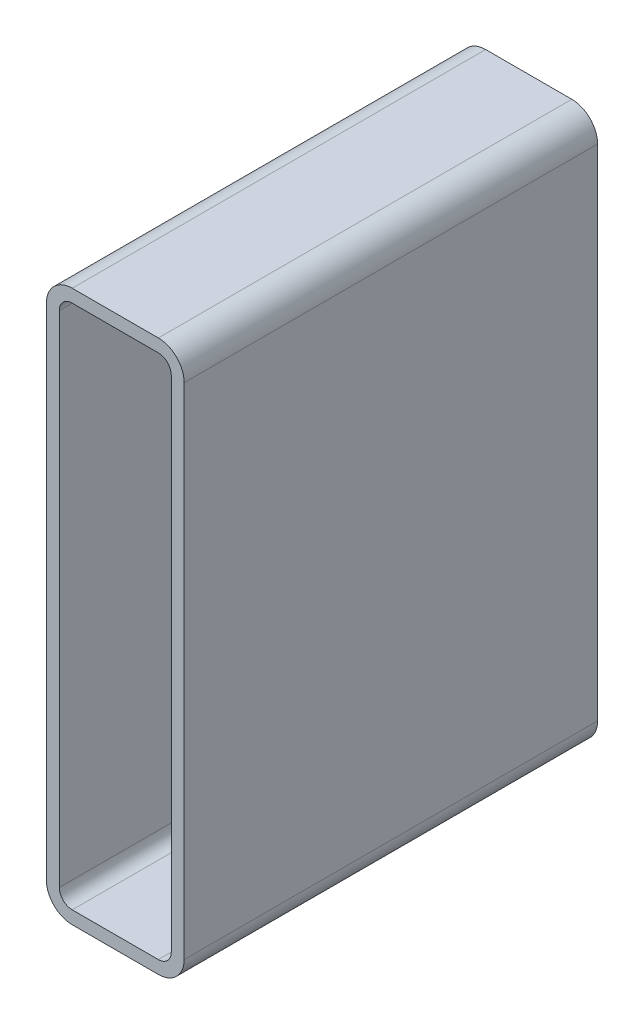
ISO-10303-21;
HEADER;
FILE_DESCRIPTION(('STEP AP214'),'2;1');
FILE_NAME('part.step','',(''),(''),'','','');
FILE_SCHEMA(('AUTOMOTIVE_DESIGN { 1 0 10303 214 1 1 1 1 }'));
ENDSEC;
DATA;
#1=APPLICATION_CONTEXT('core data for automotive mechanical design processes');
#2=APPLICATION_PROTOCOL_DEFINITION('international standard','automotive_design',2000,#1);
#3=PRODUCT_CONTEXT('',#1,'mechanical');
#4=PRODUCT('Part','Part','',(#3));
#5=PRODUCT_RELATED_PRODUCT_CATEGORY('part','',(#4));
#6=PRODUCT_DEFINITION_FORMATION('','',#4);
#7=PRODUCT_DEFINITION_CONTEXT('part definition',#1,'design');
#8=PRODUCT_DEFINITION('design','',#6,#7);
#9=PRODUCT_DEFINITION_SHAPE('','',#8);
#10=(LENGTH_UNIT() NAMED_UNIT(*) SI_UNIT(.MILLI.,.METRE.));
#11=(NAMED_UNIT(*) PLANE_ANGLE_UNIT() SI_UNIT($,.RADIAN.));
#12=(NAMED_UNIT(*) SI_UNIT($,.STERADIAN.) SOLID_ANGLE_UNIT());
#13=UNCERTAINTY_MEASURE_WITH_UNIT(LENGTH_MEASURE(1.E-05),#10,'distance_accuracy_value','');
#14=(GEOMETRIC_REPRESENTATION_CONTEXT(3) GLOBAL_UNCERTAINTY_ASSIGNED_CONTEXT((#13)) GLOBAL_UNIT_ASSIGNED_CONTEXT((#10,
#11,#12)) REPRESENTATION_CONTEXT('',''));
#15=CARTESIAN_POINT('',(0.,0.,0.));
#16=DIRECTION('',(0.,0.,1.));
#17=DIRECTION('',(1.,0.,0.));
#18=AXIS2_PLACEMENT_3D('',#15,#16,#17);
#19=CARTESIAN_POINT('',(20.7251778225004,389.132862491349,304.8));
#20=DIRECTION('',(0.,0.,1.));
#21=DIRECTION('',(1.,0.,0.));
#22=AXIS2_PLACEMENT_3D('',#19,#20,#21);
#23=PLANE('',#22);
#24=CARTESIAN_POINT('',(20.7251778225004,389.132862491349,304.8));
#25=DIRECTION('',(0.,0.,1.));
#26=DIRECTION('',(1.,0.,0.));
#27=AXIS2_PLACEMENT_3D('',#24,#25,#26);
#28=CIRCLE('',#27,19.05);
#29=CARTESIAN_POINT('',(20.7251778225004,408.182862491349,304.8));
#30=VERTEX_POINT('',#29);
#31=CARTESIAN_POINT('',(1.67517782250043,389.132862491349,304.8));
#32=VERTEX_POINT('',#31);
#33=EDGE_CURVE('E211',#30,#32,#28,.T.);
#34=ORIENTED_EDGE('',*,*,#33,.T.);
#35=DIRECTION('',(0.,-1.,0.));
#36=VECTOR('',#35,1.);
#37=CARTESIAN_POINT('',(1.67517782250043,20.8328624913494,304.8));
#38=LINE('',#37,#36);
#39=CARTESIAN_POINT('',(1.67517782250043,20.8328624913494,304.8));
#40=VERTEX_POINT('',#39);
#41=EDGE_CURVE('E214',#32,#40,#38,.T.);
#42=ORIENTED_EDGE('',*,*,#41,.T.);
#43=CARTESIAN_POINT('',(20.7251778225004,20.8328624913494,304.8));
#44=DIRECTION('',(0.,0.,1.));
#45=DIRECTION('',(1.,0.,0.));
#46=AXIS2_PLACEMENT_3D('',#43,#44,#45);
#47=CIRCLE('',#46,19.05);
#48=CARTESIAN_POINT('',(20.7251778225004,1.78286249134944,304.8));
#49=VERTEX_POINT('',#48);
#50=EDGE_CURVE('E217',#40,#49,#47,.T.);
#51=ORIENTED_EDGE('',*,*,#50,.T.);
#52=DIRECTION('',(1.,0.,0.));
#53=VECTOR('',#52,1.);
#54=CARTESIAN_POINT('',(84.2251778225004,1.78286249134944,304.8));
#55=LINE('',#54,#53);
#56=CARTESIAN_POINT('',(84.2251778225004,1.78286249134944,304.8));
#57=VERTEX_POINT('',#56);
#58=EDGE_CURVE('E219',#49,#57,#55,.T.);
#59=ORIENTED_EDGE('',*,*,#58,.T.);
#60=CARTESIAN_POINT('',(84.2251778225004,20.8328624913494,304.8));
#61=DIRECTION('',(0.,0.,1.));
#62=DIRECTION('',(1.,0.,0.));
#63=AXIS2_PLACEMENT_3D('',#60,#61,#62);
#64=CIRCLE('',#63,19.05);
#65=CARTESIAN_POINT('',(103.2751778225,20.8328624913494,304.8));
#66=VERTEX_POINT('',#65);
#67=EDGE_CURVE('E221',#57,#66,#64,.T.);
#68=ORIENTED_EDGE('',*,*,#67,.T.);
#69=DIRECTION('',(0.,1.,0.));
#70=VECTOR('',#69,1.);
#71=CARTESIAN_POINT('',(103.2751778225,389.132862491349,304.8));
#72=LINE('',#71,#70);
#73=CARTESIAN_POINT('',(103.2751778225,389.132862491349,304.8));
#74=VERTEX_POINT('',#73);
#75=EDGE_CURVE('E223',#66,#74,#72,.T.);
#76=ORIENTED_EDGE('',*,*,#75,.T.);
#77=CARTESIAN_POINT('',(84.2251778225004,389.132862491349,304.8));
#78=DIRECTION('',(0.,0.,1.));
#79=DIRECTION('',(1.,0.,0.));
#80=AXIS2_PLACEMENT_3D('',#77,#78,#79);
#81=CIRCLE('',#80,19.05);
#82=CARTESIAN_POINT('',(84.2251778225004,408.182862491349,304.8));
#83=VERTEX_POINT('',#82);
#84=EDGE_CURVE('E225',#74,#83,#81,.T.);
#85=ORIENTED_EDGE('',*,*,#84,.T.);
#86=DIRECTION('',(-1.,0.,0.));
#87=VECTOR('',#86,1.);
#88=CARTESIAN_POINT('',(20.7251778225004,408.182862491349,304.8));
#89=LINE('',#88,#87);
#90=EDGE_CURVE('E227',#83,#30,#89,.T.);
#91=ORIENTED_EDGE('',*,*,#90,.T.);
#92=EDGE_LOOP('',(#34,#42,#51,#59,#68,#76,#85,#91));
#93=FACE_BOUND('',#92,.T.);
#94=DIRECTION('',(0.,-1.,0.));
#95=VECTOR('',#94,1.);
#96=CARTESIAN_POINT('',(11.2001778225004,20.8328624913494,304.8));
#97=LINE('',#96,#95);
#98=CARTESIAN_POINT('',(11.2001778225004,389.132862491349,304.8));
#99=VERTEX_POINT('',#98);
#100=CARTESIAN_POINT('',(11.2001778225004,20.8328624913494,304.8));
#101=VERTEX_POINT('',#100);
#102=EDGE_CURVE('E154',#99,#101,#97,.T.);
#103=ORIENTED_EDGE('',*,*,#102,.F.);
#104=CARTESIAN_POINT('',(20.7251778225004,389.132862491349,304.8));
#105=DIRECTION('',(0.,0.,1.));
#106=DIRECTION('',(1.,0.,0.));
#107=AXIS2_PLACEMENT_3D('',#104,#105,#106);
#108=CIRCLE('',#107,9.525);
#109=CARTESIAN_POINT('',(20.7251778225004,398.657862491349,304.8));
#110=VERTEX_POINT('',#109);
#111=EDGE_CURVE('E146',#110,#99,#108,.T.);
#112=ORIENTED_EDGE('',*,*,#111,.F.);
#113=DIRECTION('',(-1.,0.,0.));
#114=VECTOR('',#113,1.);
#115=CARTESIAN_POINT('',(20.7251778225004,398.657862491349,304.8));
#116=LINE('',#115,#114);
#117=CARTESIAN_POINT('',(84.2251778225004,398.657862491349,304.8));
#118=VERTEX_POINT('',#117);
#119=EDGE_CURVE('E179',#118,#110,#116,.T.);
#120=ORIENTED_EDGE('',*,*,#119,.F.);
#121=CARTESIAN_POINT('',(84.2251778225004,389.132862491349,304.8));
#122=DIRECTION('',(0.,0.,1.));
#123=DIRECTION('',(1.,0.,0.));
#124=AXIS2_PLACEMENT_3D('',#121,#122,#123);
#125=CIRCLE('',#124,9.52499999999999);
#126=CARTESIAN_POINT('',(93.7501778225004,389.132862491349,304.8));
#127=VERTEX_POINT('',#126);
#128=EDGE_CURVE('E177',#127,#118,#125,.T.);
#129=ORIENTED_EDGE('',*,*,#128,.F.);
#130=DIRECTION('',(0.,1.,0.));
#131=VECTOR('',#130,1.);
#132=CARTESIAN_POINT('',(93.7501778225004,389.132862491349,304.8));
#133=LINE('',#132,#131);
#134=CARTESIAN_POINT('',(93.7501778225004,20.8328624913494,304.8));
#135=VERTEX_POINT('',#134);
#136=EDGE_CURVE('E175',#135,#127,#133,.T.);
#137=ORIENTED_EDGE('',*,*,#136,.F.);
#138=CARTESIAN_POINT('',(84.2251778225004,20.8328624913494,304.8));
#139=DIRECTION('',(0.,0.,1.));
#140=DIRECTION('',(1.,0.,0.));
#141=AXIS2_PLACEMENT_3D('',#138,#139,#140);
#142=CIRCLE('',#141,9.52500000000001);
#143=CARTESIAN_POINT('',(84.2251778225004,11.3078624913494,304.8));
#144=VERTEX_POINT('',#143);
#145=EDGE_CURVE('E173',#144,#135,#142,.T.);
#146=ORIENTED_EDGE('',*,*,#145,.F.);
#147=DIRECTION('',(1.,0.,0.));
#148=VECTOR('',#147,1.);
#149=CARTESIAN_POINT('',(84.2251778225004,11.3078624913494,304.8));
#150=LINE('',#149,#148);
#151=CARTESIAN_POINT('',(20.7251778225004,11.3078624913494,304.8));
#152=VERTEX_POINT('',#151);
#153=EDGE_CURVE('E169',#152,#144,#150,.T.);
#154=ORIENTED_EDGE('',*,*,#153,.F.);
#155=CARTESIAN_POINT('',(20.7251778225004,20.8328624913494,304.8));
#156=DIRECTION('',(0.,0.,1.));
#157=DIRECTION('',(1.,0.,0.));
#158=AXIS2_PLACEMENT_3D('',#155,#156,#157);
#159=CIRCLE('',#158,9.525);
#160=EDGE_CURVE('E167',#101,#152,#159,.T.);
#161=ORIENTED_EDGE('',*,*,#160,.F.);
#162=EDGE_LOOP('',(#103,#112,#120,#129,#137,#146,#154,#161));
#163=FACE_BOUND('',#162,.T.);
#164=ADVANCED_FACE('F33',(#93,#163),#23,.T.);
#165=CARTESIAN_POINT('',(20.7251778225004,389.132862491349,0.));
#166=DIRECTION('',(0.,0.,1.));
#167=DIRECTION('',(1.,0.,0.));
#168=AXIS2_PLACEMENT_3D('',#165,#166,#167);
#169=PLANE('',#168);
#170=CARTESIAN_POINT('',(20.7251778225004,389.132862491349,0.));
#171=DIRECTION('',(0.,0.,1.));
#172=DIRECTION('',(1.,0.,0.));
#173=AXIS2_PLACEMENT_3D('',#170,#171,#172);
#174=CIRCLE('',#173,19.05);
#175=CARTESIAN_POINT('',(20.7251778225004,408.182862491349,0.));
#176=VERTEX_POINT('',#175);
#177=CARTESIAN_POINT('',(1.67517782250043,389.132862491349,0.));
#178=VERTEX_POINT('',#177);
#179=EDGE_CURVE('E162',#176,#178,#174,.T.);
#180=ORIENTED_EDGE('',*,*,#179,.F.);
#181=DIRECTION('',(-1.,0.,0.));
#182=VECTOR('',#181,1.);
#183=CARTESIAN_POINT('',(20.7251778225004,408.182862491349,0.));
#184=LINE('',#183,#182);
#185=CARTESIAN_POINT('',(84.2251778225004,408.182862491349,0.));
#186=VERTEX_POINT('',#185);
#187=EDGE_CURVE('E215',#186,#176,#184,.T.);
#188=ORIENTED_EDGE('',*,*,#187,.F.);
#189=CARTESIAN_POINT('',(84.2251778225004,389.132862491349,0.));
#190=DIRECTION('',(0.,0.,1.));
#191=DIRECTION('',(1.,0.,0.));
#192=AXIS2_PLACEMENT_3D('',#189,#190,#191);
#193=CIRCLE('',#192,19.05);
#194=CARTESIAN_POINT('',(103.2751778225,389.132862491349,0.));
#195=VERTEX_POINT('',#194);
#196=EDGE_CURVE('E242',#195,#186,#193,.T.);
#197=ORIENTED_EDGE('',*,*,#196,.F.);
#198=DIRECTION('',(0.,1.,0.));
#199=VECTOR('',#198,1.);
#200=CARTESIAN_POINT('',(103.2751778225,389.132862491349,0.));
#201=LINE('',#200,#199);
#202=CARTESIAN_POINT('',(103.2751778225,20.8328624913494,0.));
#203=VERTEX_POINT('',#202);
#204=EDGE_CURVE('E240',#203,#195,#201,.T.);
#205=ORIENTED_EDGE('',*,*,#204,.F.);
#206=CARTESIAN_POINT('',(84.2251778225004,20.8328624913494,0.));
#207=DIRECTION('',(0.,0.,1.));
#208=DIRECTION('',(1.,0.,0.));
#209=AXIS2_PLACEMENT_3D('',#206,#207,#208);
#210=CIRCLE('',#209,19.05);
#211=CARTESIAN_POINT('',(84.2251778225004,1.78286249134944,0.));
#212=VERTEX_POINT('',#211);
#213=EDGE_CURVE('E238',#212,#203,#210,.T.);
#214=ORIENTED_EDGE('',*,*,#213,.F.);
#215=DIRECTION('',(1.,0.,0.));
#216=VECTOR('',#215,1.);
#217=CARTESIAN_POINT('',(84.2251778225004,1.78286249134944,0.));
#218=LINE('',#217,#216);
#219=CARTESIAN_POINT('',(20.7251778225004,1.78286249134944,0.));
#220=VERTEX_POINT('',#219);
#221=EDGE_CURVE('E236',#220,#212,#218,.T.);
#222=ORIENTED_EDGE('',*,*,#221,.F.);
#223=CARTESIAN_POINT('',(20.7251778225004,20.8328624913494,0.));
#224=DIRECTION('',(0.,0.,1.));
#225=DIRECTION('',(1.,0.,0.));
#226=AXIS2_PLACEMENT_3D('',#223,#224,#225);
#227=CIRCLE('',#226,19.05);
#228=CARTESIAN_POINT('',(1.67517782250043,20.8328624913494,0.));
#229=VERTEX_POINT('',#228);
#230=EDGE_CURVE('E234',#229,#220,#227,.T.);
#231=ORIENTED_EDGE('',*,*,#230,.F.);
#232=DIRECTION('',(0.,-1.,0.));
#233=VECTOR('',#232,1.);
#234=CARTESIAN_POINT('',(1.67517782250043,20.8328624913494,0.));
#235=LINE('',#234,#233);
#236=EDGE_CURVE('E232',#178,#229,#235,.T.);
#237=ORIENTED_EDGE('',*,*,#236,.F.);
#238=EDGE_LOOP('',(#180,#188,#197,#205,#214,#222,#231,#237));
#239=FACE_BOUND('',#238,.T.);
#240=CARTESIAN_POINT('',(20.7251778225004,389.132862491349,0.));
#241=DIRECTION('',(0.,0.,1.));
#242=DIRECTION('',(1.,0.,0.));
#243=AXIS2_PLACEMENT_3D('',#240,#241,#242);
#244=CIRCLE('',#243,9.525);
#245=CARTESIAN_POINT('',(20.7251778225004,398.657862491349,0.));
#246=VERTEX_POINT('',#245);
#247=CARTESIAN_POINT('',(11.2001778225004,389.132862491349,0.));
#248=VERTEX_POINT('',#247);
#249=EDGE_CURVE('E56',#246,#248,#244,.T.);
#250=ORIENTED_EDGE('',*,*,#249,.T.);
#251=DIRECTION('',(0.,-1.,0.));
#252=VECTOR('',#251,1.);
#253=CARTESIAN_POINT('',(11.2001778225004,20.8328624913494,0.));
#254=LINE('',#253,#252);
#255=CARTESIAN_POINT('',(11.2001778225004,20.8328624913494,0.));
#256=VERTEX_POINT('',#255);
#257=EDGE_CURVE('E161',#248,#256,#254,.T.);
#258=ORIENTED_EDGE('',*,*,#257,.T.);
#259=CARTESIAN_POINT('',(20.7251778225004,20.8328624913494,0.));
#260=DIRECTION('',(0.,0.,1.));
#261=DIRECTION('',(1.,0.,0.));
#262=AXIS2_PLACEMENT_3D('',#259,#260,#261);
#263=CIRCLE('',#262,9.525);
#264=CARTESIAN_POINT('',(20.7251778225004,11.3078624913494,0.));
#265=VERTEX_POINT('',#264);
#266=EDGE_CURVE('E183',#256,#265,#263,.T.);
#267=ORIENTED_EDGE('',*,*,#266,.T.);
#268=DIRECTION('',(1.,0.,0.));
#269=VECTOR('',#268,1.);
#270=CARTESIAN_POINT('',(84.2251778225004,11.3078624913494,0.));
#271=LINE('',#270,#269);
#272=CARTESIAN_POINT('',(84.2251778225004,11.3078624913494,0.));
#273=VERTEX_POINT('',#272);
#274=EDGE_CURVE('E186',#265,#273,#271,.T.);
#275=ORIENTED_EDGE('',*,*,#274,.T.);
#276=CARTESIAN_POINT('',(84.2251778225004,20.8328624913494,0.));
#277=DIRECTION('',(0.,0.,1.));
#278=DIRECTION('',(1.,0.,0.));
#279=AXIS2_PLACEMENT_3D('',#276,#277,#278);
#280=CIRCLE('',#279,9.52500000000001);
#281=CARTESIAN_POINT('',(93.7501778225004,20.8328624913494,0.));
#282=VERTEX_POINT('',#281);
#283=EDGE_CURVE('E189',#273,#282,#280,.T.);
#284=ORIENTED_EDGE('',*,*,#283,.T.);
#285=DIRECTION('',(0.,1.,0.));
#286=VECTOR('',#285,1.);
#287=CARTESIAN_POINT('',(93.7501778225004,389.132862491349,0.));
#288=LINE('',#287,#286);
#289=CARTESIAN_POINT('',(93.7501778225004,389.132862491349,0.));
#290=VERTEX_POINT('',#289);
#291=EDGE_CURVE('E192',#282,#290,#288,.T.);
#292=ORIENTED_EDGE('',*,*,#291,.T.);
#293=CARTESIAN_POINT('',(84.2251778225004,389.132862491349,0.));
#294=DIRECTION('',(0.,0.,1.));
#295=DIRECTION('',(1.,0.,0.));
#296=AXIS2_PLACEMENT_3D('',#293,#294,#295);
#297=CIRCLE('',#296,9.52499999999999);
#298=CARTESIAN_POINT('',(84.2251778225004,398.657862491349,0.));
#299=VERTEX_POINT('',#298);
#300=EDGE_CURVE('E195',#290,#299,#297,.T.);
#301=ORIENTED_EDGE('',*,*,#300,.T.);
#302=DIRECTION('',(-1.,0.,0.));
#303=VECTOR('',#302,1.);
#304=CARTESIAN_POINT('',(20.7251778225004,398.657862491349,0.));
#305=LINE('',#304,#303);
#306=EDGE_CURVE('E155',#299,#246,#305,.T.);
#307=ORIENTED_EDGE('',*,*,#306,.T.);
#308=EDGE_LOOP('',(#250,#258,#267,#275,#284,#292,#301,#307));
#309=FACE_BOUND('',#308,.T.);
#310=ADVANCED_FACE('F272',(#239,#309),#169,.F.);
#311=CARTESIAN_POINT('',(20.7251778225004,389.132862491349,304.8));
#312=DIRECTION('',(0.,0.,-1.));
#313=DIRECTION('',(-1.,0.,0.));
#314=AXIS2_PLACEMENT_3D('',#311,#312,#313);
#315=CYLINDRICAL_SURFACE('',#314,19.05);
#316=ORIENTED_EDGE('',*,*,#179,.T.);
#317=DIRECTION('',(0.,0.,-1.));
#318=VECTOR('',#317,1.);
#319=CARTESIAN_POINT('',(1.67517782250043,389.132862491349,304.8));
#320=LINE('',#319,#318);
#321=EDGE_CURVE('E11',#32,#178,#320,.T.);
#322=ORIENTED_EDGE('',*,*,#321,.F.);
#323=ORIENTED_EDGE('',*,*,#33,.F.);
#324=DIRECTION('',(0.,0.,-1.));
#325=VECTOR('',#324,1.);
#326=CARTESIAN_POINT('',(20.7251778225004,408.182862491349,304.8));
#327=LINE('',#326,#325);
#328=EDGE_CURVE('E229',#30,#176,#327,.T.);
#329=ORIENTED_EDGE('',*,*,#328,.T.);
#330=EDGE_LOOP('',(#316,#322,#323,#329));
#331=FACE_BOUND('',#330,.T.);
#332=ADVANCED_FACE('F35',(#331),#315,.T.);
#333=CARTESIAN_POINT('',(1.67517782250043,20.8328624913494,304.8));
#334=DIRECTION('',(1.,0.,0.));
#335=DIRECTION('',(0.,0.,-1.));
#336=AXIS2_PLACEMENT_3D('',#333,#334,#335);
#337=PLANE('',#336);
#338=ORIENTED_EDGE('',*,*,#236,.T.);
#339=DIRECTION('',(0.,0.,-1.));
#340=VECTOR('',#339,1.);
#341=CARTESIAN_POINT('',(1.67517782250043,20.8328624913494,304.8));
#342=LINE('',#341,#340);
#343=EDGE_CURVE('E41',#40,#229,#342,.T.);
#344=ORIENTED_EDGE('',*,*,#343,.F.);
#345=ORIENTED_EDGE('',*,*,#41,.F.);
#346=ORIENTED_EDGE('',*,*,#321,.T.);
#347=EDGE_LOOP('',(#338,#344,#345,#346));
#348=FACE_BOUND('',#347,.T.);
#349=ADVANCED_FACE('F289',(#348),#337,.F.);
#350=CARTESIAN_POINT('',(20.7251778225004,20.8328624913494,304.8));
#351=DIRECTION('',(0.,0.,-1.));
#352=DIRECTION('',(-1.,0.,0.));
#353=AXIS2_PLACEMENT_3D('',#350,#351,#352);
#354=CYLINDRICAL_SURFACE('',#353,19.05);
#355=ORIENTED_EDGE('',*,*,#230,.T.);
#356=DIRECTION('',(0.,0.,-1.));
#357=VECTOR('',#356,1.);
#358=CARTESIAN_POINT('',(20.7251778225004,1.78286249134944,304.8));
#359=LINE('',#358,#357);
#360=EDGE_CURVE('E259',#49,#220,#359,.T.);
#361=ORIENTED_EDGE('',*,*,#360,.F.);
#362=ORIENTED_EDGE('',*,*,#50,.F.);
#363=ORIENTED_EDGE('',*,*,#343,.T.);
#364=EDGE_LOOP('',(#355,#361,#362,#363));
#365=FACE_BOUND('',#364,.T.);
#366=ADVANCED_FACE('F266',(#365),#354,.T.);
#367=CARTESIAN_POINT('',(84.2251778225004,1.78286249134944,304.8));
#368=DIRECTION('',(0.,1.,0.));
#369=DIRECTION('',(0.,0.,1.));
#370=AXIS2_PLACEMENT_3D('',#367,#368,#369);
#371=PLANE('',#370);
#372=ORIENTED_EDGE('',*,*,#221,.T.);
#373=DIRECTION('',(0.,0.,-1.));
#374=VECTOR('',#373,1.);
#375=CARTESIAN_POINT('',(84.2251778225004,1.78286249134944,304.8));
#376=LINE('',#375,#374);
#377=EDGE_CURVE('E256',#57,#212,#376,.T.);
#378=ORIENTED_EDGE('',*,*,#377,.F.);
#379=ORIENTED_EDGE('',*,*,#58,.F.);
#380=ORIENTED_EDGE('',*,*,#360,.T.);
#381=EDGE_LOOP('',(#372,#378,#379,#380));
#382=FACE_BOUND('',#381,.T.);
#383=ADVANCED_FACE('F278',(#382),#371,.F.);
#384=CARTESIAN_POINT('',(84.2251778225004,20.8328624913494,304.8));
#385=DIRECTION('',(0.,0.,-1.));
#386=DIRECTION('',(-1.,0.,0.));
#387=AXIS2_PLACEMENT_3D('',#384,#385,#386);
#388=CYLINDRICAL_SURFACE('',#387,19.05);
#389=ORIENTED_EDGE('',*,*,#213,.T.);
#390=DIRECTION('',(0.,0.,-1.));
#391=VECTOR('',#390,1.);
#392=CARTESIAN_POINT('',(103.2751778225,20.8328624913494,304.8));
#393=LINE('',#392,#391);
#394=EDGE_CURVE('E253',#66,#203,#393,.T.);
#395=ORIENTED_EDGE('',*,*,#394,.F.);
#396=ORIENTED_EDGE('',*,*,#67,.F.);
#397=ORIENTED_EDGE('',*,*,#377,.T.);
#398=EDGE_LOOP('',(#389,#395,#396,#397));
#399=FACE_BOUND('',#398,.T.);
#400=ADVANCED_FACE('F282',(#399),#388,.T.);
#401=CARTESIAN_POINT('',(103.2751778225,389.132862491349,304.8));
#402=DIRECTION('',(-1.,0.,0.));
#403=DIRECTION('',(0.,0.,1.));
#404=AXIS2_PLACEMENT_3D('',#401,#402,#403);
#405=PLANE('',#404);
#406=ORIENTED_EDGE('',*,*,#204,.T.);
#407=DIRECTION('',(0.,0.,-1.));
#408=VECTOR('',#407,1.);
#409=CARTESIAN_POINT('',(103.2751778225,389.132862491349,304.8));
#410=LINE('',#409,#408);
#411=EDGE_CURVE('E250',#74,#195,#410,.T.);
#412=ORIENTED_EDGE('',*,*,#411,.F.);
#413=ORIENTED_EDGE('',*,*,#75,.F.);
#414=ORIENTED_EDGE('',*,*,#394,.T.);
#415=EDGE_LOOP('',(#406,#412,#413,#414));
#416=FACE_BOUND('',#415,.T.);
#417=ADVANCED_FACE('F302',(#416),#405,.F.);
#418=CARTESIAN_POINT('',(84.2251778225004,389.132862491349,304.8));
#419=DIRECTION('',(0.,0.,-1.));
#420=DIRECTION('',(-1.,0.,0.));
#421=AXIS2_PLACEMENT_3D('',#418,#419,#420);
#422=CYLINDRICAL_SURFACE('',#421,19.05);
#423=ORIENTED_EDGE('',*,*,#196,.T.);
#424=DIRECTION('',(0.,0.,-1.));
#425=VECTOR('',#424,1.);
#426=CARTESIAN_POINT('',(84.2251778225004,408.182862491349,304.8));
#427=LINE('',#426,#425);
#428=EDGE_CURVE('E247',#83,#186,#427,.T.);
#429=ORIENTED_EDGE('',*,*,#428,.F.);
#430=ORIENTED_EDGE('',*,*,#84,.F.);
#431=ORIENTED_EDGE('',*,*,#411,.T.);
#432=EDGE_LOOP('',(#423,#429,#430,#431));
#433=FACE_BOUND('',#432,.T.);
#434=ADVANCED_FACE('F300',(#433),#422,.T.);
#435=CARTESIAN_POINT('',(20.7251778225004,408.182862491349,304.8));
#436=DIRECTION('',(0.,-1.,0.));
#437=DIRECTION('',(0.,0.,-1.));
#438=AXIS2_PLACEMENT_3D('',#435,#436,#437);
#439=PLANE('',#438);
#440=ORIENTED_EDGE('',*,*,#187,.T.);
#441=ORIENTED_EDGE('',*,*,#328,.F.);
#442=ORIENTED_EDGE('',*,*,#90,.F.);
#443=ORIENTED_EDGE('',*,*,#428,.T.);
#444=EDGE_LOOP('',(#440,#441,#442,#443));
#445=FACE_BOUND('',#444,.T.);
#446=ADVANCED_FACE('F295',(#445),#439,.F.);
#447=CARTESIAN_POINT('',(20.7251778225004,389.132862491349,304.8));
#448=DIRECTION('',(0.,0.,-1.));
#449=DIRECTION('',(-1.,0.,0.));
#450=AXIS2_PLACEMENT_3D('',#447,#448,#449);
#451=CYLINDRICAL_SURFACE('',#450,9.525);
#452=ORIENTED_EDGE('',*,*,#249,.F.);
#453=DIRECTION('',(0.,0.,-1.));
#454=VECTOR('',#453,1.);
#455=CARTESIAN_POINT('',(20.7251778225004,398.657862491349,304.8));
#456=LINE('',#455,#454);
#457=EDGE_CURVE('E150',#110,#246,#456,.T.);
#458=ORIENTED_EDGE('',*,*,#457,.F.);
#459=ORIENTED_EDGE('',*,*,#111,.T.);
#460=DIRECTION('',(0.,0.,-1.));
#461=VECTOR('',#460,1.);
#462=CARTESIAN_POINT('',(11.2001778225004,389.132862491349,304.8));
#463=LINE('',#462,#461);
#464=EDGE_CURVE('E149',#99,#248,#463,.T.);
#465=ORIENTED_EDGE('',*,*,#464,.T.);
#466=EDGE_LOOP('',(#452,#458,#459,#465));
#467=FACE_BOUND('',#466,.T.);
#468=ADVANCED_FACE('F148',(#467),#451,.F.);
#469=CARTESIAN_POINT('',(11.2001778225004,20.8328624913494,304.8));
#470=DIRECTION('',(1.,0.,0.));
#471=DIRECTION('',(0.,0.,-1.));
#472=AXIS2_PLACEMENT_3D('',#469,#470,#471);
#473=PLANE('',#472);
#474=ORIENTED_EDGE('',*,*,#257,.F.);
#475=ORIENTED_EDGE('',*,*,#464,.F.);
#476=ORIENTED_EDGE('',*,*,#102,.T.);
#477=DIRECTION('',(0.,0.,-1.));
#478=VECTOR('',#477,1.);
#479=CARTESIAN_POINT('',(11.2001778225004,20.8328624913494,304.8));
#480=LINE('',#479,#478);
#481=EDGE_CURVE('E163',#101,#256,#480,.T.);
#482=ORIENTED_EDGE('',*,*,#481,.T.);
#483=EDGE_LOOP('',(#474,#475,#476,#482));
#484=FACE_BOUND('',#483,.T.);
#485=ADVANCED_FACE('F158',(#484),#473,.T.);
#486=CARTESIAN_POINT('',(20.7251778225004,20.8328624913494,304.8));
#487=DIRECTION('',(0.,0.,-1.));
#488=DIRECTION('',(-1.,0.,0.));
#489=AXIS2_PLACEMENT_3D('',#486,#487,#488);
#490=CYLINDRICAL_SURFACE('',#489,9.525);
#491=ORIENTED_EDGE('',*,*,#266,.F.);
#492=ORIENTED_EDGE('',*,*,#481,.F.);
#493=ORIENTED_EDGE('',*,*,#160,.T.);
#494=DIRECTION('',(0.,0.,-1.));
#495=VECTOR('',#494,1.);
#496=CARTESIAN_POINT('',(20.7251778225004,11.3078624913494,304.8));
#497=LINE('',#496,#495);
#498=EDGE_CURVE('E208',#152,#265,#497,.T.);
#499=ORIENTED_EDGE('',*,*,#498,.T.);
#500=EDGE_LOOP('',(#491,#492,#493,#499));
#501=FACE_BOUND('',#500,.T.);
#502=ADVANCED_FACE('F327',(#501),#490,.F.);
#503=CARTESIAN_POINT('',(84.2251778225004,11.3078624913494,304.8));
#504=DIRECTION('',(0.,1.,0.));
#505=DIRECTION('',(0.,0.,1.));
#506=AXIS2_PLACEMENT_3D('',#503,#504,#505);
#507=PLANE('',#506);
#508=ORIENTED_EDGE('',*,*,#274,.F.);
#509=ORIENTED_EDGE('',*,*,#498,.F.);
#510=ORIENTED_EDGE('',*,*,#153,.T.);
#511=DIRECTION('',(0.,0.,-1.));
#512=VECTOR('',#511,1.);
#513=CARTESIAN_POINT('',(84.2251778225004,11.3078624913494,304.8));
#514=LINE('',#513,#512);
#515=EDGE_CURVE('E206',#144,#273,#514,.T.);
#516=ORIENTED_EDGE('',*,*,#515,.T.);
#517=EDGE_LOOP('',(#508,#509,#510,#516));
#518=FACE_BOUND('',#517,.T.);
#519=ADVANCED_FACE('F331',(#518),#507,.T.);
#520=CARTESIAN_POINT('',(84.2251778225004,20.8328624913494,304.8));
#521=DIRECTION('',(0.,0.,-1.));
#522=DIRECTION('',(-1.,0.,0.));
#523=AXIS2_PLACEMENT_3D('',#520,#521,#522);
#524=CYLINDRICAL_SURFACE('',#523,9.52500000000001);
#525=ORIENTED_EDGE('',*,*,#283,.F.);
#526=ORIENTED_EDGE('',*,*,#515,.F.);
#527=ORIENTED_EDGE('',*,*,#145,.T.);
#528=DIRECTION('',(0.,0.,-1.));
#529=VECTOR('',#528,1.);
#530=CARTESIAN_POINT('',(93.7501778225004,20.8328624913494,304.8));
#531=LINE('',#530,#529);
#532=EDGE_CURVE('E204',#135,#282,#531,.T.);
#533=ORIENTED_EDGE('',*,*,#532,.T.);
#534=EDGE_LOOP('',(#525,#526,#527,#533));
#535=FACE_BOUND('',#534,.T.);
#536=ADVANCED_FACE('F337',(#535),#524,.F.);
#537=CARTESIAN_POINT('',(93.7501778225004,389.132862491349,304.8));
#538=DIRECTION('',(-1.,0.,0.));
#539=DIRECTION('',(0.,0.,1.));
#540=AXIS2_PLACEMENT_3D('',#537,#538,#539);
#541=PLANE('',#540);
#542=ORIENTED_EDGE('',*,*,#291,.F.);
#543=ORIENTED_EDGE('',*,*,#532,.F.);
#544=ORIENTED_EDGE('',*,*,#136,.T.);
#545=DIRECTION('',(0.,0.,-1.));
#546=VECTOR('',#545,1.);
#547=CARTESIAN_POINT('',(93.7501778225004,389.132862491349,304.8));
#548=LINE('',#547,#546);
#549=EDGE_CURVE('E202',#127,#290,#548,.T.);
#550=ORIENTED_EDGE('',*,*,#549,.T.);
#551=EDGE_LOOP('',(#542,#543,#544,#550));
#552=FACE_BOUND('',#551,.T.);
#553=ADVANCED_FACE('F341',(#552),#541,.T.);
#554=CARTESIAN_POINT('',(84.2251778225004,389.132862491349,304.8));
#555=DIRECTION('',(0.,0.,-1.));
#556=DIRECTION('',(-1.,0.,0.));
#557=AXIS2_PLACEMENT_3D('',#554,#555,#556);
#558=CYLINDRICAL_SURFACE('',#557,9.52499999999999);
#559=ORIENTED_EDGE('',*,*,#300,.F.);
#560=ORIENTED_EDGE('',*,*,#549,.F.);
#561=ORIENTED_EDGE('',*,*,#128,.T.);
#562=DIRECTION('',(0.,0.,-1.));
#563=VECTOR('',#562,1.);
#564=CARTESIAN_POINT('',(84.2251778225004,398.657862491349,304.8));
#565=LINE('',#564,#563);
#566=EDGE_CURVE('E48',#118,#299,#565,.T.);
#567=ORIENTED_EDGE('',*,*,#566,.T.);
#568=EDGE_LOOP('',(#559,#560,#561,#567));
#569=FACE_BOUND('',#568,.T.);
#570=ADVANCED_FACE('F345',(#569),#558,.F.);
#571=CARTESIAN_POINT('',(20.7251778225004,398.657862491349,304.8));
#572=DIRECTION('',(0.,-1.,0.));
#573=DIRECTION('',(0.,0.,-1.));
#574=AXIS2_PLACEMENT_3D('',#571,#572,#573);
#575=PLANE('',#574);
#576=ORIENTED_EDGE('',*,*,#306,.F.);
#577=ORIENTED_EDGE('',*,*,#566,.F.);
#578=ORIENTED_EDGE('',*,*,#119,.T.);
#579=ORIENTED_EDGE('',*,*,#457,.T.);
#580=EDGE_LOOP('',(#576,#577,#578,#579));
#581=FACE_BOUND('',#580,.T.);
#582=ADVANCED_FACE('F349',(#581),#575,.T.);
#583=CLOSED_SHELL('',(#164,#310,#332,#349,#366,#383,#400,#417,#434,#446,#468,#485,#502,#519,
#536,#553,#570,#582));
#584=MANIFOLD_SOLID_BREP('B2',#583);
#585=ADVANCED_BREP_SHAPE_REPRESENTATION('',(#18,#584),#14);
#586=SHAPE_DEFINITION_REPRESENTATION(#9,#585);
ENDSEC;
END-ISO-10303-21;
